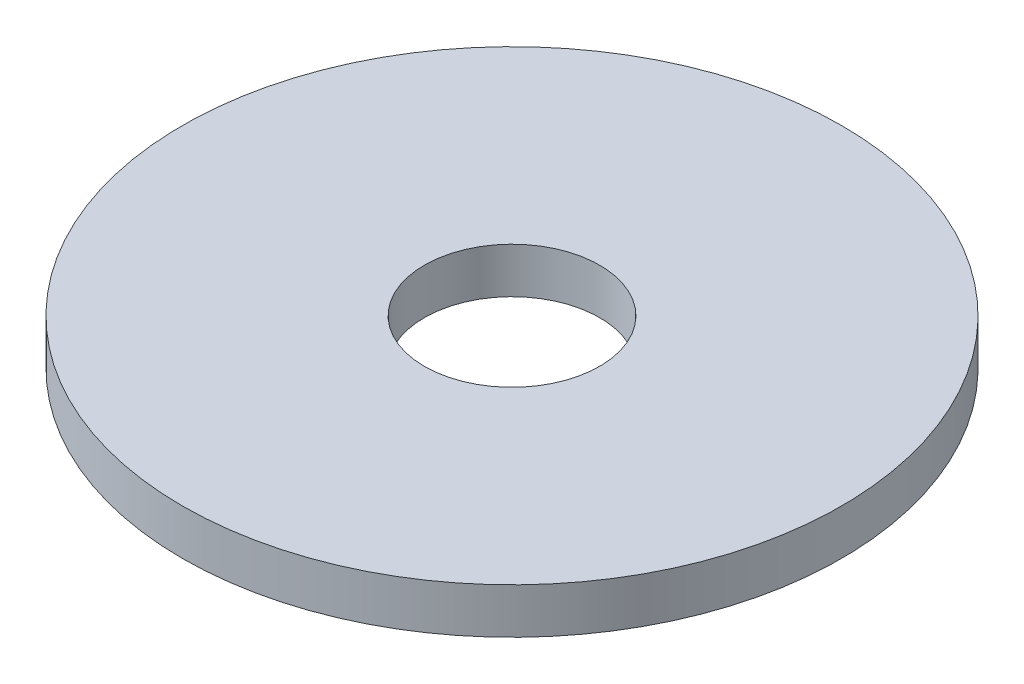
from build123d import *

# Parameters (mm, degrees)
SKETCH1_R           = 12.7
BOSS_EXTRUDE1_DEPTH = 1.7526
SKETCH5_R           = 3.3782
CUT_EXTRUDE1_DEPTH  = 19.045819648


with BuildPart() as part:
    # Sketch1 → Boss-Extrude1 (new body)
    with BuildSketch(Plane(origin=(0, 0, 0), x_dir=(1, 0, 0), z_dir=(0, 1, 0))):
        with Locations(Location((0, 0, 0), (0, 0, 270))):
            Circle(SKETCH1_R)
    extrude(amount=BOSS_EXTRUDE1_DEPTH)

    # Sketch5 → Cut-Extrude1 (cut, through all)
    with BuildSketch(Plane(origin=(0, 1.7526, 0), x_dir=(-1, 0, 0), z_dir=(0, 1, 0))):
        with Locations(Location((0, 0, 0), (0, 0, 90))):
            Circle(SKETCH5_R)
    extrude(amount=-CUT_EXTRUDE1_DEPTH, mode=Mode.SUBTRACT)


solid = part.part
